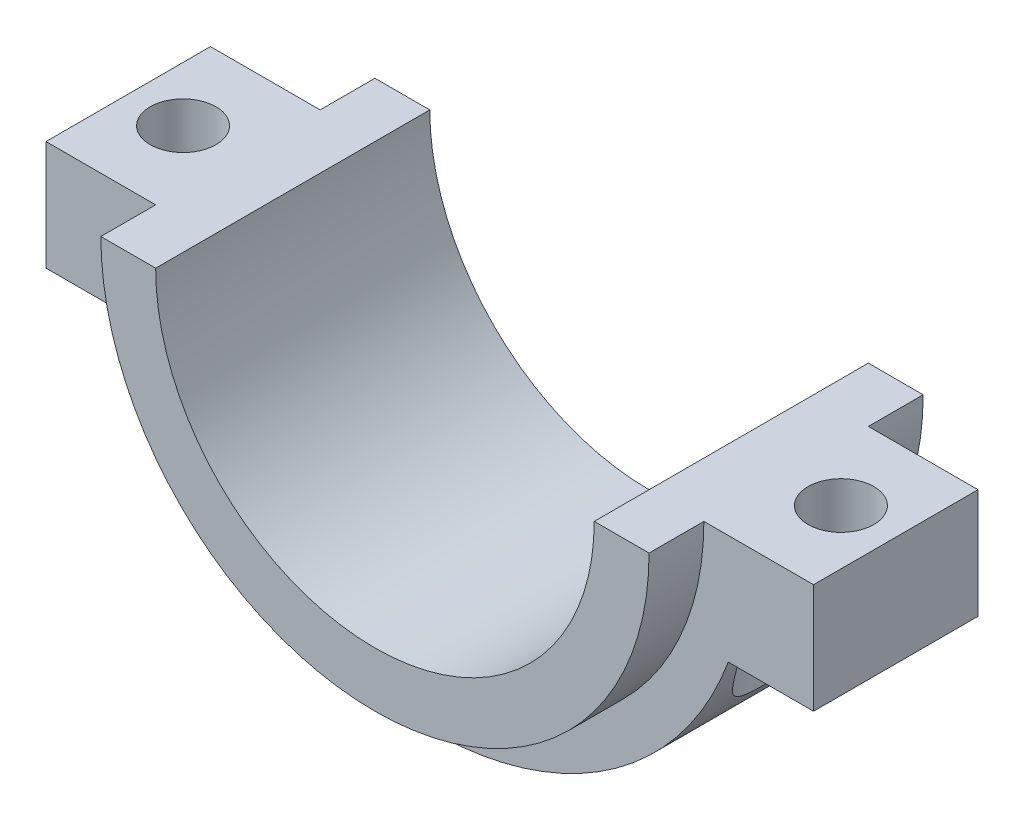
ISO-10303-21;
HEADER;
FILE_DESCRIPTION(('STEP AP214'),'2;1');
FILE_NAME('part.step','',(''),(''),'','','');
FILE_SCHEMA(('AUTOMOTIVE_DESIGN { 1 0 10303 214 1 1 1 1 }'));
ENDSEC;
DATA;
#1=APPLICATION_CONTEXT('core data for automotive mechanical design processes');
#2=APPLICATION_PROTOCOL_DEFINITION('international standard','automotive_design',2000,#1);
#3=PRODUCT_CONTEXT('',#1,'mechanical');
#4=PRODUCT('Part','Part','',(#3));
#5=PRODUCT_RELATED_PRODUCT_CATEGORY('part','',(#4));
#6=PRODUCT_DEFINITION_FORMATION('','',#4);
#7=PRODUCT_DEFINITION_CONTEXT('part definition',#1,'design');
#8=PRODUCT_DEFINITION('design','',#6,#7);
#9=PRODUCT_DEFINITION_SHAPE('','',#8);
#10=(LENGTH_UNIT() NAMED_UNIT(*) SI_UNIT(.MILLI.,.METRE.));
#11=(NAMED_UNIT(*) PLANE_ANGLE_UNIT() SI_UNIT($,.RADIAN.));
#12=(NAMED_UNIT(*) SI_UNIT($,.STERADIAN.) SOLID_ANGLE_UNIT());
#13=UNCERTAINTY_MEASURE_WITH_UNIT(LENGTH_MEASURE(1.E-05),#10,'distance_accuracy_value','');
#14=(GEOMETRIC_REPRESENTATION_CONTEXT(3) GLOBAL_UNCERTAINTY_ASSIGNED_CONTEXT((#13)) GLOBAL_UNIT_ASSIGNED_CONTEXT((#10,
#11,#12)) REPRESENTATION_CONTEXT('',''));
#15=CARTESIAN_POINT('',(0.,0.,0.));
#16=DIRECTION('',(0.,0.,1.));
#17=DIRECTION('',(1.,0.,0.));
#18=AXIS2_PLACEMENT_3D('',#15,#16,#17);
#19=CARTESIAN_POINT('',(0.,0.,15.));
#20=DIRECTION('',(0.,0.,-1.));
#21=DIRECTION('',(-1.,0.,0.));
#22=AXIS2_PLACEMENT_3D('',#19,#20,#21);
#23=CYLINDRICAL_SURFACE('',#22,58.);
#24=CARTESIAN_POINT('',(-54.4426303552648,-20.,-12.8497331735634));
#25=CARTESIAN_POINT('',(-54.2826467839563,-20.4355339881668,-12.7805017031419));
#26=CARTESIAN_POINT('',(-54.1176847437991,-20.8683993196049,-12.7056478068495));
#27=CARTESIAN_POINT('',(-53.7782681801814,-21.7281186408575,-12.5429569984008));
#28=CARTESIAN_POINT('',(-53.6038099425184,-22.1549701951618,-12.4551149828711));
#29=CARTESIAN_POINT('',(-53.2446160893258,-23.0048999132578,-12.2640294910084));
#30=CARTESIAN_POINT('',(-53.0598117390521,-23.4279237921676,-12.1606727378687));
#31=CARTESIAN_POINT('',(-52.6819381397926,-24.2657061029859,-11.9370927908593));
#32=CARTESIAN_POINT('',(-52.4888698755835,-24.6804655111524,-11.8168716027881));
#33=CARTESIAN_POINT('',(-52.0916321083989,-25.5083647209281,-11.554887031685));
#34=CARTESIAN_POINT('',(-51.8873205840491,-25.9213202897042,-11.4127541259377));
#35=CARTESIAN_POINT('',(-51.4723985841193,-26.7357633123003,-11.1061502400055));
#36=CARTESIAN_POINT('',(-51.2617871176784,-27.1372489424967,-10.9416757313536));
#37=CARTESIAN_POINT('',(-50.836767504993,-27.925307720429,-10.5882628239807));
#38=CARTESIAN_POINT('',(-50.6223743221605,-28.3119260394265,-10.3994076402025));
#39=CARTESIAN_POINT('',(-50.191466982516,-29.0689889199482,-9.99400586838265));
#40=CARTESIAN_POINT('',(-49.9749538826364,-29.439441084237,-9.77747248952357));
#41=CARTESIAN_POINT('',(-49.60349810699,-30.0596830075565,-9.37894550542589));
#42=CARTESIAN_POINT('',(-49.4483569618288,-30.3141178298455,-9.2043536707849));
#43=CARTESIAN_POINT('',(-49.1398326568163,-30.8117266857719,-8.83821754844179));
#44=CARTESIAN_POINT('',(-48.9864497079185,-31.0548993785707,-8.64667125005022));
#45=CARTESIAN_POINT('',(-48.6835324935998,-31.5276427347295,-8.24623571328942));
#46=CARTESIAN_POINT('',(-48.533988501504,-31.7572502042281,-8.03739748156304));
#47=CARTESIAN_POINT('',(-48.2402128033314,-32.2017519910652,-7.6010894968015));
#48=CARTESIAN_POINT('',(-48.0959809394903,-32.416646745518,-7.37362029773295));
#49=CARTESIAN_POINT('',(-47.81318875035,-32.8323469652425,-6.8963449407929));
#50=CARTESIAN_POINT('',(-47.6747285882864,-33.0329286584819,-6.64628328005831));
#51=CARTESIAN_POINT('',(-47.4082039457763,-33.4143131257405,-6.12633387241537));
#52=CARTESIAN_POINT('',(-47.2801369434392,-33.5951207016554,-5.85645096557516));
#53=CARTESIAN_POINT('',(-47.0374049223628,-33.9341418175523,-5.29753237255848));
#54=CARTESIAN_POINT('',(-46.9227258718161,-34.0923790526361,-5.00851724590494));
#55=CARTESIAN_POINT('',(-46.7097275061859,-34.3836289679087,-4.41233649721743));
#56=CARTESIAN_POINT('',(-46.6114011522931,-34.5166525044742,-4.1051787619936));
#57=CARTESIAN_POINT('',(-46.4589952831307,-34.7213647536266,-3.56325142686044));
#58=CARTESIAN_POINT('',(-46.4002381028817,-34.799794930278,-3.33231881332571));
#59=CARTESIAN_POINT('',(-46.293824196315,-34.9412318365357,-2.86330595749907));
#60=CARTESIAN_POINT('',(-46.2461647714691,-35.004242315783,-2.62522746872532));
#61=CARTESIAN_POINT('',(-46.1628881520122,-35.1139931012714,-2.14338233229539));
#62=CARTESIAN_POINT('',(-46.1272657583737,-35.1607404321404,-1.89961818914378));
#63=CARTESIAN_POINT('',(-46.0687740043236,-35.2373437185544,-1.40791792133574));
#64=CARTESIAN_POINT('',(-46.0459050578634,-35.2671991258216,-1.15998166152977));
#65=CARTESIAN_POINT('',(-46.0133746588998,-35.3096314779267,-0.661048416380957));
#66=CARTESIAN_POINT('',(-46.0037512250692,-35.322158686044,-0.410044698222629));
#67=CARTESIAN_POINT('',(-45.9980508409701,-35.3295816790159,0.092377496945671));
#68=CARTESIAN_POINT('',(-46.0019738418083,-35.3244775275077,0.343795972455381));
#69=CARTESIAN_POINT('',(-46.0232779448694,-35.2967164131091,0.845095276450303));
#70=CARTESIAN_POINT('',(-46.0406597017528,-35.2740585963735,1.09497602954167));
#71=CARTESIAN_POINT('',(-46.0884965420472,-35.2115326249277,1.5912980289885));
#72=CARTESIAN_POINT('',(-46.1189515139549,-35.1716646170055,1.83773930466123));
#73=CARTESIAN_POINT('',(-46.1908328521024,-35.077205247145,2.315819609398));
#74=CARTESIAN_POINT('',(-46.2317788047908,-35.0232570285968,2.54765898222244));
#75=CARTESIAN_POINT('',(-46.324359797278,-34.9007103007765,3.00522059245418));
#76=CARTESIAN_POINT('',(-46.3759942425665,-34.8321126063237,3.23094316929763));
#77=CARTESIAN_POINT('',(-46.4890663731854,-34.6810553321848,3.67521818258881));
#78=CARTESIAN_POINT('',(-46.5505061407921,-34.5985928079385,3.89376908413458));
#79=CARTESIAN_POINT('',(-46.6822018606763,-34.4206955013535,4.32280435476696));
#80=CARTESIAN_POINT('',(-46.7524596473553,-34.3252580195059,4.53328703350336));
#81=CARTESIAN_POINT('',(-46.9281261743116,-34.0849018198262,5.02155161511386));
#82=CARTESIAN_POINT('',(-47.0369434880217,-33.9347140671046,5.29552977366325));
#83=CARTESIAN_POINT('',(-47.2665667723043,-33.6141419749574,5.82608949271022));
#84=CARTESIAN_POINT('',(-47.3873763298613,-33.4437515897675,6.0826658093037));
#85=CARTESIAN_POINT('',(-47.6385784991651,-33.0849482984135,6.57818202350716));
#86=CARTESIAN_POINT('',(-47.7689782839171,-32.89652186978,6.81710844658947));
#87=CARTESIAN_POINT('',(-48.0370377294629,-32.5038397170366,7.27725705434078));
#88=CARTESIAN_POINT('',(-48.1746995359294,-32.2995793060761,7.49847395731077));
#89=CARTESIAN_POINT('',(-48.5178925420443,-31.7828306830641,8.01853893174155));
#90=CARTESIAN_POINT('',(-48.7262886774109,-31.4627327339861,8.30795969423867));
#91=CARTESIAN_POINT('',(-49.1489088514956,-30.798376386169,8.85284202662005));
#92=CARTESIAN_POINT('',(-49.3631356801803,-30.4541062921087,9.10828698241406));
#93=CARTESIAN_POINT('',(-49.7944975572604,-29.7435994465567,9.58919281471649));
#94=CARTESIAN_POINT('',(-50.0116421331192,-29.3772518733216,9.81448029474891));
#95=CARTESIAN_POINT('',(-50.4444289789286,-28.6277287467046,10.2363262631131));
#96=CARTESIAN_POINT('',(-50.6600714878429,-28.2445559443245,10.4328894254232));
#97=CARTESIAN_POINT('',(-51.0407332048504,-27.5493119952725,10.7601109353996));
#98=CARTESIAN_POINT('',(-51.2065200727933,-27.2399948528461,10.8957859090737));
#99=CARTESIAN_POINT('',(-51.5348057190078,-26.6136955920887,11.1527551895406));
#100=CARTESIAN_POINT('',(-51.6973041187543,-26.2967126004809,11.2740478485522));
#101=CARTESIAN_POINT('',(-52.0183942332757,-25.6557071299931,11.5036061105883));
#102=CARTESIAN_POINT('',(-52.1769818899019,-25.3316779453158,11.6118585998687));
#103=CARTESIAN_POINT('',(-52.4894812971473,-24.6776360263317,11.8163860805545));
#104=CARTESIAN_POINT('',(-52.6433928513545,-24.3476230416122,11.9126605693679));
#105=CARTESIAN_POINT('',(-52.9430663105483,-23.6888182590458,12.092544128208));
#106=CARTESIAN_POINT('',(-53.0889289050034,-23.3601297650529,12.1763648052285));
#107=CARTESIAN_POINT('',(-53.3753081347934,-22.698161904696,12.3345128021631));
#108=CARTESIAN_POINT('',(-53.5158245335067,-22.3648823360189,12.4088397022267));
#109=CARTESIAN_POINT('',(-53.7908324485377,-21.6950923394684,12.5487051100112));
#110=CARTESIAN_POINT('',(-53.9253388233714,-21.3585926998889,12.6142661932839));
#111=CARTESIAN_POINT('',(-54.1884579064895,-20.6819467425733,12.7376207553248));
#112=CARTESIAN_POINT('',(-54.3170715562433,-20.341801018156,12.7954154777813));
#113=CARTESIAN_POINT('',(-54.4426303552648,-20.,12.8497331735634));
#114=B_SPLINE_CURVE_WITH_KNOTS('',3,(#24,#25,#26,#27,#28,#29,#30,#31,#32,#33,#34,#35,#36,#37,
#38,#39,#40,#41,#42,#43,#44,#45,#46,#47,#48,#49,#50,#51,#52,#53,#54,#55,#56,#57,#58,#59,#60,#61,
#62,#63,#64,#65,#66,#67,#68,#69,#70,#71,#72,#73,#74,#75,#76,#77,#78,#79,#80,#81,#82,#83,#84,#85,
#86,#87,#88,#89,#90,#91,#92,#93,#94,#95,#96,#97,#98,#99,#100,#101,#102,#103,#104,#105,#106,#107,
#108,#109,#110,#111,#112,#113),.UNSPECIFIED.,.F.,.F.,(4,2,2,2,2,2,2,2,2,2,2,2,2,2,2,2,2,2,2,2,2,
2,2,2,2,2,2,2,2,2,2,2,2,2,2,2,2,2,2,2,2,2,2,2,4),(0.,1.40737975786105,2.81531398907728,
4.23407866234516,5.65267473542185,7.0985272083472,8.54460829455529,9.9858780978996,
11.4264626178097,12.4620816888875,13.4978237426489,14.5306126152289,15.5633707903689,
16.609779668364,17.655933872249,18.7009815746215,19.7455782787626,20.4974312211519,
21.2491011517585,22.0004460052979,22.7518152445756,23.5053366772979,24.2588553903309,
25.0124107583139,25.7659596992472,26.4897701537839,27.213540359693,27.9374644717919,
28.66153943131,29.6526139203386,30.6439857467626,31.6361067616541,32.6285225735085,
34.0639471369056,35.5000710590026,36.944126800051,38.3879473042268,39.5163502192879,
40.6448822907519,41.7745399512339,42.904244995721,44.0117633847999,45.1193307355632,
46.223988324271,47.3284688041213),.UNSPECIFIED.);
#115=CARTESIAN_POINT('',(-54.4426303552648,-20.,-12.8497331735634));
#116=VERTEX_POINT('',#115);
#117=CARTESIAN_POINT('',(-54.4426303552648,-20.,12.8497331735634));
#118=VERTEX_POINT('',#117);
#119=EDGE_CURVE('E11',#116,#118,#114,.T.);
#120=ORIENTED_EDGE('',*,*,#119,.F.);
#121=DIRECTION('',(0.,0.,-1.));
#122=VECTOR('',#121,1.);
#123=CARTESIAN_POINT('',(-54.4426303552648,-20.,15.));
#124=LINE('',#123,#122);
#125=CARTESIAN_POINT('',(-54.4426303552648,-20.,-15.));
#126=VERTEX_POINT('',#125);
#127=EDGE_CURVE('E129',#116,#126,#124,.T.);
#128=ORIENTED_EDGE('',*,*,#127,.T.);
#129=CARTESIAN_POINT('',(0.,0.,-15.));
#130=DIRECTION('',(0.,0.,1.));
#131=DIRECTION('',(1.,0.,0.));
#132=AXIS2_PLACEMENT_3D('',#129,#130,#131);
#133=CIRCLE('',#132,58.);
#134=CARTESIAN_POINT('',(54.4426303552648,-20.,-15.));
#135=VERTEX_POINT('',#134);
#136=EDGE_CURVE('E154',#126,#135,#133,.T.);
#137=ORIENTED_EDGE('',*,*,#136,.T.);
#138=DIRECTION('',(0.,0.,-1.));
#139=VECTOR('',#138,1.);
#140=CARTESIAN_POINT('',(54.4426303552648,-20.,15.));
#141=LINE('',#140,#139);
#142=CARTESIAN_POINT('',(54.4426303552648,-20.,-12.8497331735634));
#143=VERTEX_POINT('',#142);
#144=EDGE_CURVE('E130',#143,#135,#141,.T.);
#145=ORIENTED_EDGE('',*,*,#144,.F.);
#146=CARTESIAN_POINT('',(54.4426303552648,-20.,12.8497331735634));
#147=CARTESIAN_POINT('',(54.2826467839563,-20.4355339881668,12.7805017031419));
#148=CARTESIAN_POINT('',(54.1176847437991,-20.8683993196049,12.7056478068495));
#149=CARTESIAN_POINT('',(53.7782681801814,-21.7281186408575,12.5429569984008));
#150=CARTESIAN_POINT('',(53.6038099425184,-22.1549701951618,12.4551149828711));
#151=CARTESIAN_POINT('',(53.2446160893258,-23.0048999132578,12.2640294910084));
#152=CARTESIAN_POINT('',(53.0598117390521,-23.4279237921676,12.1606727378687));
#153=CARTESIAN_POINT('',(52.6819381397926,-24.2657061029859,11.9370927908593));
#154=CARTESIAN_POINT('',(52.4888698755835,-24.6804655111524,11.8168716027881));
#155=CARTESIAN_POINT('',(52.0916321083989,-25.5083647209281,11.554887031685));
#156=CARTESIAN_POINT('',(51.8873205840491,-25.9213202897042,11.4127541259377));
#157=CARTESIAN_POINT('',(51.4723985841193,-26.7357633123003,11.1061502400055));
#158=CARTESIAN_POINT('',(51.2617871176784,-27.1372489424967,10.9416757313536));
#159=CARTESIAN_POINT('',(50.836767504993,-27.9253077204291,10.5882628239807));
#160=CARTESIAN_POINT('',(50.6223743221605,-28.3119260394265,10.3994076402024));
#161=CARTESIAN_POINT('',(50.191466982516,-29.0689889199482,9.99400586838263));
#162=CARTESIAN_POINT('',(49.9749538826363,-29.439441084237,9.77747248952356));
#163=CARTESIAN_POINT('',(49.60349810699,-30.0596830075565,9.37894550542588));
#164=CARTESIAN_POINT('',(49.4483569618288,-30.3141178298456,9.20435367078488));
#165=CARTESIAN_POINT('',(49.1398326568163,-30.8117266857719,8.83821754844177));
#166=CARTESIAN_POINT('',(48.9864497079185,-31.0548993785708,8.6466712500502));
#167=CARTESIAN_POINT('',(48.6835324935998,-31.5276427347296,8.2462357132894));
#168=CARTESIAN_POINT('',(48.533988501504,-31.7572502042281,8.03739748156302));
#169=CARTESIAN_POINT('',(48.2402128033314,-32.2017519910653,7.60108949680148));
#170=CARTESIAN_POINT('',(48.0959809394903,-32.416646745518,7.37362029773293));
#171=CARTESIAN_POINT('',(47.81318875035,-32.8323469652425,6.89634494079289));
#172=CARTESIAN_POINT('',(47.6747285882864,-33.0329286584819,6.64628328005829));
#173=CARTESIAN_POINT('',(47.4082039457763,-33.4143131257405,6.12633387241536));
#174=CARTESIAN_POINT('',(47.2801369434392,-33.5951207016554,5.85645096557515));
#175=CARTESIAN_POINT('',(47.0374049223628,-33.9341418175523,5.29753237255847));
#176=CARTESIAN_POINT('',(46.9227258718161,-34.0923790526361,5.00851724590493));
#177=CARTESIAN_POINT('',(46.7097275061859,-34.3836289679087,4.41233649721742));
#178=CARTESIAN_POINT('',(46.6114011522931,-34.5166525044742,4.10517876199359));
#179=CARTESIAN_POINT('',(46.4589952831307,-34.7213647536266,3.56325142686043));
#180=CARTESIAN_POINT('',(46.4002381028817,-34.799794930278,3.3323188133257));
#181=CARTESIAN_POINT('',(46.293824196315,-34.9412318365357,2.86330595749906));
#182=CARTESIAN_POINT('',(46.2461647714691,-35.004242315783,2.62522746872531));
#183=CARTESIAN_POINT('',(46.1628881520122,-35.1139931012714,2.14338233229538));
#184=CARTESIAN_POINT('',(46.1272657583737,-35.1607404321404,1.89961818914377));
#185=CARTESIAN_POINT('',(46.0687740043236,-35.2373437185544,1.40791792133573));
#186=CARTESIAN_POINT('',(46.0459050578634,-35.2671991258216,1.15998166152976));
#187=CARTESIAN_POINT('',(46.0133746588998,-35.3096314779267,0.661048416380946));
#188=CARTESIAN_POINT('',(46.0037512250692,-35.3221586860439,0.410044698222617));
#189=CARTESIAN_POINT('',(45.9980508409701,-35.3295816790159,-0.092377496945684));
#190=CARTESIAN_POINT('',(46.0019738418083,-35.3244775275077,-0.343795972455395));
#191=CARTESIAN_POINT('',(46.0232779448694,-35.2967164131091,-0.845095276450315));
#192=CARTESIAN_POINT('',(46.0406597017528,-35.2740585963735,-1.09497602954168));
#193=CARTESIAN_POINT('',(46.0884965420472,-35.2115326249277,-1.59129802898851));
#194=CARTESIAN_POINT('',(46.1189515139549,-35.1716646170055,-1.83773930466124));
#195=CARTESIAN_POINT('',(46.1908328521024,-35.077205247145,-2.31581960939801));
#196=CARTESIAN_POINT('',(46.2317788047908,-35.0232570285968,-2.54765898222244));
#197=CARTESIAN_POINT('',(46.324359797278,-34.9007103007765,-3.00522059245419));
#198=CARTESIAN_POINT('',(46.3759942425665,-34.8321126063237,-3.23094316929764));
#199=CARTESIAN_POINT('',(46.4890663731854,-34.6810553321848,-3.67521818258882));
#200=CARTESIAN_POINT('',(46.5505061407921,-34.5985928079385,-3.89376908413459));
#201=CARTESIAN_POINT('',(46.6822018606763,-34.4206955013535,-4.32280435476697));
#202=CARTESIAN_POINT('',(46.7524596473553,-34.3252580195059,-4.53328703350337));
#203=CARTESIAN_POINT('',(46.9281261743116,-34.0849018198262,-5.02155161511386));
#204=CARTESIAN_POINT('',(47.0369434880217,-33.9347140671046,-5.29552977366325));
#205=CARTESIAN_POINT('',(47.2665667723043,-33.6141419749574,-5.82608949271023));
#206=CARTESIAN_POINT('',(47.3873763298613,-33.4437515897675,-6.08266580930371));
#207=CARTESIAN_POINT('',(47.6385784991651,-33.0849482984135,-6.57818202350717));
#208=CARTESIAN_POINT('',(47.7689782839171,-32.89652186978,-6.81710844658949));
#209=CARTESIAN_POINT('',(48.0370377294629,-32.5038397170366,-7.27725705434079));
#210=CARTESIAN_POINT('',(48.1746995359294,-32.2995793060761,-7.49847395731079));
#211=CARTESIAN_POINT('',(48.5178925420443,-31.782830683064,-8.01853893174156));
#212=CARTESIAN_POINT('',(48.7262886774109,-31.4627327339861,-8.30795969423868));
#213=CARTESIAN_POINT('',(49.1489088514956,-30.798376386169,-8.85284202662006));
#214=CARTESIAN_POINT('',(49.3631356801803,-30.4541062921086,-9.10828698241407));
#215=CARTESIAN_POINT('',(49.7944975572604,-29.7435994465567,-9.58919281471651));
#216=CARTESIAN_POINT('',(50.0116421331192,-29.3772518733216,-9.81448029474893));
#217=CARTESIAN_POINT('',(50.4444289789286,-28.6277287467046,-10.2363262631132));
#218=CARTESIAN_POINT('',(50.6600714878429,-28.2445559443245,-10.4328894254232));
#219=CARTESIAN_POINT('',(51.0407332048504,-27.5493119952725,-10.7601109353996));
#220=CARTESIAN_POINT('',(51.2065200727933,-27.2399948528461,-10.8957859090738));
#221=CARTESIAN_POINT('',(51.5348057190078,-26.6136955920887,-11.1527551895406));
#222=CARTESIAN_POINT('',(51.6973041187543,-26.2967126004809,-11.2740478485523));
#223=CARTESIAN_POINT('',(52.0183942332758,-25.6557071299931,-11.5036061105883));
#224=CARTESIAN_POINT('',(52.1769818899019,-25.3316779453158,-11.6118585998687));
#225=CARTESIAN_POINT('',(52.4894812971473,-24.6776360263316,-11.8163860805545));
#226=CARTESIAN_POINT('',(52.6433928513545,-24.3476230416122,-11.912660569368));
#227=CARTESIAN_POINT('',(52.9430663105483,-23.6888182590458,-12.092544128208));
#228=CARTESIAN_POINT('',(53.0889289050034,-23.3601297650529,-12.1763648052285));
#229=CARTESIAN_POINT('',(53.3753081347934,-22.698161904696,-12.3345128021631));
#230=CARTESIAN_POINT('',(53.5158245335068,-22.3648823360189,-12.4088397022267));
#231=CARTESIAN_POINT('',(53.7908324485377,-21.6950923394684,-12.5487051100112));
#232=CARTESIAN_POINT('',(53.9253388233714,-21.3585926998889,-12.6142661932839));
#233=CARTESIAN_POINT('',(54.1884579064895,-20.6819467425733,-12.7376207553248));
#234=CARTESIAN_POINT('',(54.3170715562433,-20.341801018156,-12.7954154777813));
#235=CARTESIAN_POINT('',(54.4426303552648,-20.,-12.8497331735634));
#236=B_SPLINE_CURVE_WITH_KNOTS('',3,(#146,#147,#148,#149,#150,#151,#152,#153,#154,#155,#156,
#157,#158,#159,#160,#161,#162,#163,#164,#165,#166,#167,#168,#169,#170,#171,#172,#173,#174,#175,
#176,#177,#178,#179,#180,#181,#182,#183,#184,#185,#186,#187,#188,#189,#190,#191,#192,#193,#194,
#195,#196,#197,#198,#199,#200,#201,#202,#203,#204,#205,#206,#207,#208,#209,#210,#211,#212,#213,
#214,#215,#216,#217,#218,#219,#220,#221,#222,#223,#224,#225,#226,#227,#228,#229,#230,#231,#232,
#233,#234,#235),.UNSPECIFIED.,.F.,.F.,(4,2,2,2,2,2,2,2,2,2,2,2,2,2,2,2,2,2,2,2,2,2,2,2,2,2,2,2,
2,2,2,2,2,2,2,2,2,2,2,2,2,2,2,2,4),(0.,1.40737975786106,2.81531398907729,4.23407866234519,
5.65267473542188,7.09852720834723,8.54460829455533,9.98587809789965,11.4264626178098,
12.4620816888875,13.4978237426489,14.5306126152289,15.5633707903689,16.609779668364,
17.655933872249,18.7009815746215,19.7455782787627,20.4974312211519,21.2491011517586,
22.0004460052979,22.7518152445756,23.5053366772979,24.2588553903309,25.0124107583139,
25.7659596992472,26.4897701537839,27.213540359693,27.937464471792,28.66153943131,
29.6526139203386,30.6439857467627,31.6361067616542,32.6285225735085,34.0639471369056,
35.5000710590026,36.944126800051,38.3879473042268,39.5163502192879,40.6448822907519,
41.7745399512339,42.904244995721,44.0117633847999,45.1193307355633,46.223988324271,
47.3284688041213),.UNSPECIFIED.);
#237=CARTESIAN_POINT('',(54.4426303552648,-20.,12.8497331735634));
#238=VERTEX_POINT('',#237);
#239=EDGE_CURVE('E126',#238,#143,#236,.T.);
#240=ORIENTED_EDGE('',*,*,#239,.F.);
#241=CARTESIAN_POINT('',(54.4426303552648,-20.,15.));
#242=VERTEX_POINT('',#241);
#243=EDGE_CURVE('E121',#242,#238,#141,.T.);
#244=ORIENTED_EDGE('',*,*,#243,.F.);
#245=CARTESIAN_POINT('',(0.,0.,15.));
#246=DIRECTION('',(0.,0.,1.));
#247=DIRECTION('',(1.,0.,0.));
#248=AXIS2_PLACEMENT_3D('',#245,#246,#247);
#249=CIRCLE('',#248,58.);
#250=CARTESIAN_POINT('',(-54.4426303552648,-20.,15.));
#251=VERTEX_POINT('',#250);
#252=EDGE_CURVE('E108',#251,#242,#249,.T.);
#253=ORIENTED_EDGE('',*,*,#252,.F.);
#254=EDGE_CURVE('E169',#251,#118,#124,.T.);
#255=ORIENTED_EDGE('',*,*,#254,.T.);
#256=EDGE_LOOP('',(#120,#128,#137,#145,#240,#244,#253,#255));
#257=FACE_BOUND('',#256,.T.);
#258=ADVANCED_FACE('F34',(#257),#23,.T.);
#259=CARTESIAN_POINT('',(0.,0.,15.));
#260=DIRECTION('',(0.,-1.,0.));
#261=DIRECTION('',(1.,0.,0.));
#262=AXIS2_PLACEMENT_3D('',#259,#260,#261);
#263=PLANE('',#262);
#264=CARTESIAN_POINT('',(-60.,0.,0.));
#265=DIRECTION('',(0.,-1.,0.));
#266=DIRECTION('',(0.,0.,-1.));
#267=AXIS2_PLACEMENT_3D('',#264,#265,#266);
#268=CIRCLE('',#267,6.);
#269=CARTESIAN_POINT('',(-60.,0.,-6.));
#270=VERTEX_POINT('',#269);
#271=EDGE_CURVE('E221',#270,#270,#268,.T.);
#272=ORIENTED_EDGE('',*,*,#271,.T.);
#273=EDGE_LOOP('',(#272));
#274=FACE_BOUND('',#273,.T.);
#275=DIRECTION('',(-1.,0.,0.));
#276=VECTOR('',#275,1.);
#277=CARTESIAN_POINT('',(0.,0.,-15.));
#278=LINE('',#277,#276);
#279=CARTESIAN_POINT('',(-50.,0.,-15.));
#280=VERTEX_POINT('',#279);
#281=CARTESIAN_POINT('',(-70.,0.,-15.));
#282=VERTEX_POINT('',#281);
#283=EDGE_CURVE('E145',#280,#282,#278,.T.);
#284=ORIENTED_EDGE('',*,*,#283,.T.);
#285=DIRECTION('',(0.,0.,-1.));
#286=VECTOR('',#285,1.);
#287=CARTESIAN_POINT('',(-70.,0.,15.));
#288=LINE('',#287,#286);
#289=CARTESIAN_POINT('',(-70.,0.,15.));
#290=VERTEX_POINT('',#289);
#291=EDGE_CURVE('E48',#290,#282,#288,.T.);
#292=ORIENTED_EDGE('',*,*,#291,.F.);
#293=DIRECTION('',(-1.,0.,0.));
#294=VECTOR('',#293,1.);
#295=CARTESIAN_POINT('',(0.,0.,15.));
#296=LINE('',#295,#294);
#297=CARTESIAN_POINT('',(-50.,0.,15.));
#298=VERTEX_POINT('',#297);
#299=EDGE_CURVE('E97',#298,#290,#296,.T.);
#300=ORIENTED_EDGE('',*,*,#299,.F.);
#301=DIRECTION('',(0.,0.,-1.));
#302=VECTOR('',#301,1.);
#303=CARTESIAN_POINT('',(-50.,0.,25.));
#304=LINE('',#303,#302);
#305=CARTESIAN_POINT('',(-50.,0.,25.));
#306=VERTEX_POINT('',#305);
#307=EDGE_CURVE('E146',#306,#298,#304,.T.);
#308=ORIENTED_EDGE('',*,*,#307,.F.);
#309=DIRECTION('',(-1.,0.,0.));
#310=VECTOR('',#309,1.);
#311=CARTESIAN_POINT('',(0.,0.,25.));
#312=LINE('',#311,#310);
#313=CARTESIAN_POINT('',(-40.,0.,25.));
#314=VERTEX_POINT('',#313);
#315=EDGE_CURVE('E212',#314,#306,#312,.T.);
#316=ORIENTED_EDGE('',*,*,#315,.F.);
#317=DIRECTION('',(0.,0.,-1.));
#318=VECTOR('',#317,1.);
#319=CARTESIAN_POINT('',(-40.,0.,25.));
#320=LINE('',#319,#318);
#321=CARTESIAN_POINT('',(-40.,0.,-25.));
#322=VERTEX_POINT('',#321);
#323=EDGE_CURVE('E205',#314,#322,#320,.T.);
#324=ORIENTED_EDGE('',*,*,#323,.T.);
#325=DIRECTION('',(-1.,0.,0.));
#326=VECTOR('',#325,1.);
#327=CARTESIAN_POINT('',(0.,0.,-25.));
#328=LINE('',#327,#326);
#329=CARTESIAN_POINT('',(-50.,0.,-25.));
#330=VERTEX_POINT('',#329);
#331=EDGE_CURVE('E218',#322,#330,#328,.T.);
#332=ORIENTED_EDGE('',*,*,#331,.T.);
#333=EDGE_CURVE('E198',#280,#330,#304,.T.);
#334=ORIENTED_EDGE('',*,*,#333,.F.);
#335=EDGE_LOOP('',(#284,#292,#300,#308,#316,#324,#332,#334));
#336=FACE_BOUND('',#335,.T.);
#337=ADVANCED_FACE('F36',(#274,#336),#263,.F.);
#338=CARTESIAN_POINT('',(-70.,0.,15.));
#339=DIRECTION('',(1.,0.,0.));
#340=DIRECTION('',(0.,0.,-1.));
#341=AXIS2_PLACEMENT_3D('',#338,#339,#340);
#342=PLANE('',#341);
#343=DIRECTION('',(0.,-1.,0.));
#344=VECTOR('',#343,1.);
#345=CARTESIAN_POINT('',(-70.,0.,-15.));
#346=LINE('',#345,#344);
#347=CARTESIAN_POINT('',(-70.,-20.,-15.));
#348=VERTEX_POINT('',#347);
#349=EDGE_CURVE('E148',#282,#348,#346,.T.);
#350=ORIENTED_EDGE('',*,*,#349,.T.);
#351=DIRECTION('',(0.,0.,-1.));
#352=VECTOR('',#351,1.);
#353=CARTESIAN_POINT('',(-70.,-20.,15.));
#354=LINE('',#353,#352);
#355=CARTESIAN_POINT('',(-70.,-20.,15.));
#356=VERTEX_POINT('',#355);
#357=EDGE_CURVE('E171',#356,#348,#354,.T.);
#358=ORIENTED_EDGE('',*,*,#357,.F.);
#359=DIRECTION('',(0.,-1.,0.));
#360=VECTOR('',#359,1.);
#361=CARTESIAN_POINT('',(-70.,0.,15.));
#362=LINE('',#361,#360);
#363=EDGE_CURVE('E179',#290,#356,#362,.T.);
#364=ORIENTED_EDGE('',*,*,#363,.F.);
#365=ORIENTED_EDGE('',*,*,#291,.T.);
#366=EDGE_LOOP('',(#350,#358,#364,#365));
#367=FACE_BOUND('',#366,.T.);
#368=ADVANCED_FACE('F176',(#367),#342,.F.);
#369=CARTESIAN_POINT('',(0.,-20.,15.));
#370=DIRECTION('',(0.,1.,0.));
#371=DIRECTION('',(0.,0.,1.));
#372=AXIS2_PLACEMENT_3D('',#369,#370,#371);
#373=PLANE('',#372);
#374=ORIENTED_EDGE('',*,*,#357,.T.);
#375=DIRECTION('',(1.,0.,0.));
#376=VECTOR('',#375,1.);
#377=CARTESIAN_POINT('',(0.,-20.,-15.));
#378=LINE('',#377,#376);
#379=EDGE_CURVE('E151',#348,#126,#378,.T.);
#380=ORIENTED_EDGE('',*,*,#379,.T.);
#381=ORIENTED_EDGE('',*,*,#127,.F.);
#382=CARTESIAN_POINT('',(-60.,-20.,0.));
#383=DIRECTION('',(0.,-1.,0.));
#384=DIRECTION('',(0.,0.,-1.));
#385=AXIS2_PLACEMENT_3D('',#382,#383,#384);
#386=CIRCLE('',#385,14.);
#387=EDGE_CURVE('E248',#116,#118,#386,.T.);
#388=ORIENTED_EDGE('',*,*,#387,.T.);
#389=ORIENTED_EDGE('',*,*,#254,.F.);
#390=DIRECTION('',(1.,0.,0.));
#391=VECTOR('',#390,1.);
#392=CARTESIAN_POINT('',(0.,-20.,15.));
#393=LINE('',#392,#391);
#394=EDGE_CURVE('E114',#356,#251,#393,.T.);
#395=ORIENTED_EDGE('',*,*,#394,.F.);
#396=EDGE_LOOP('',(#374,#380,#381,#388,#389,#395));
#397=FACE_BOUND('',#396,.T.);
#398=CARTESIAN_POINT('',(-60.,-20.,0.));
#399=DIRECTION('',(0.,-1.,0.));
#400=DIRECTION('',(0.,0.,-1.));
#401=AXIS2_PLACEMENT_3D('',#398,#399,#400);
#402=CIRCLE('',#401,6.);
#403=CARTESIAN_POINT('',(-60.,-20.,-6.));
#404=VERTEX_POINT('',#403);
#405=EDGE_CURVE('E238',#404,#404,#402,.T.);
#406=ORIENTED_EDGE('',*,*,#405,.F.);
#407=EDGE_LOOP('',(#406));
#408=FACE_BOUND('',#407,.T.);
#409=ADVANCED_FACE('F187',(#397,#408),#373,.F.);
#410=CARTESIAN_POINT('',(0.,-20.,15.));
#411=DIRECTION('',(0.,-1.,0.));
#412=DIRECTION('',(0.,0.,-1.));
#413=AXIS2_PLACEMENT_3D('',#410,#411,#412);
#414=PLANE('',#413);
#415=CARTESIAN_POINT('',(60.,-20.,0.));
#416=DIRECTION('',(0.,-1.,0.));
#417=DIRECTION('',(0.,0.,-1.));
#418=AXIS2_PLACEMENT_3D('',#415,#416,#417);
#419=CIRCLE('',#418,14.);
#420=EDGE_CURVE('E249',#238,#143,#419,.T.);
#421=ORIENTED_EDGE('',*,*,#420,.T.);
#422=ORIENTED_EDGE('',*,*,#144,.T.);
#423=DIRECTION('',(-1.,0.,0.));
#424=VECTOR('',#423,1.);
#425=CARTESIAN_POINT('',(0.,-20.,-15.));
#426=LINE('',#425,#424);
#427=CARTESIAN_POINT('',(70.,-20.,-15.));
#428=VERTEX_POINT('',#427);
#429=EDGE_CURVE('E157',#428,#135,#426,.T.);
#430=ORIENTED_EDGE('',*,*,#429,.F.);
#431=DIRECTION('',(0.,0.,-1.));
#432=VECTOR('',#431,1.);
#433=CARTESIAN_POINT('',(70.,-20.,15.));
#434=LINE('',#433,#432);
#435=CARTESIAN_POINT('',(70.,-20.,15.));
#436=VERTEX_POINT('',#435);
#437=EDGE_CURVE('E135',#436,#428,#434,.T.);
#438=ORIENTED_EDGE('',*,*,#437,.F.);
#439=DIRECTION('',(-1.,0.,0.));
#440=VECTOR('',#439,1.);
#441=CARTESIAN_POINT('',(0.,-20.,15.));
#442=LINE('',#441,#440);
#443=EDGE_CURVE('E112',#436,#242,#442,.T.);
#444=ORIENTED_EDGE('',*,*,#443,.T.);
#445=ORIENTED_EDGE('',*,*,#243,.T.);
#446=EDGE_LOOP('',(#421,#422,#430,#438,#444,#445));
#447=FACE_BOUND('',#446,.T.);
#448=CARTESIAN_POINT('',(60.,-20.,0.));
#449=DIRECTION('',(0.,-1.,0.));
#450=DIRECTION('',(0.,0.,-1.));
#451=AXIS2_PLACEMENT_3D('',#448,#449,#450);
#452=CIRCLE('',#451,6.);
#453=CARTESIAN_POINT('',(60.,-20.,-6.));
#454=VERTEX_POINT('',#453);
#455=EDGE_CURVE('E235',#454,#454,#452,.T.);
#456=ORIENTED_EDGE('',*,*,#455,.F.);
#457=EDGE_LOOP('',(#456));
#458=FACE_BOUND('',#457,.T.);
#459=ADVANCED_FACE('F132',(#447,#458),#414,.T.);
#460=CARTESIAN_POINT('',(70.,0.,15.));
#461=DIRECTION('',(1.,0.,0.));
#462=DIRECTION('',(0.,0.,-1.));
#463=AXIS2_PLACEMENT_3D('',#460,#461,#462);
#464=PLANE('',#463);
#465=DIRECTION('',(0.,-1.,0.));
#466=VECTOR('',#465,1.);
#467=CARTESIAN_POINT('',(70.,0.,-15.));
#468=LINE('',#467,#466);
#469=CARTESIAN_POINT('',(70.,0.,-15.));
#470=VERTEX_POINT('',#469);
#471=EDGE_CURVE('E160',#470,#428,#468,.T.);
#472=ORIENTED_EDGE('',*,*,#471,.F.);
#473=DIRECTION('',(0.,0.,-1.));
#474=VECTOR('',#473,1.);
#475=CARTESIAN_POINT('',(70.,0.,15.));
#476=LINE('',#475,#474);
#477=CARTESIAN_POINT('',(70.,0.,15.));
#478=VERTEX_POINT('',#477);
#479=EDGE_CURVE('E56',#478,#470,#476,.T.);
#480=ORIENTED_EDGE('',*,*,#479,.F.);
#481=DIRECTION('',(0.,-1.,0.));
#482=VECTOR('',#481,1.);
#483=CARTESIAN_POINT('',(70.,0.,15.));
#484=LINE('',#483,#482);
#485=EDGE_CURVE('E136',#478,#436,#484,.T.);
#486=ORIENTED_EDGE('',*,*,#485,.T.);
#487=ORIENTED_EDGE('',*,*,#437,.T.);
#488=EDGE_LOOP('',(#472,#480,#486,#487));
#489=FACE_BOUND('',#488,.T.);
#490=ADVANCED_FACE('F293',(#489),#464,.T.);
#491=CARTESIAN_POINT('',(0.,0.,15.));
#492=DIRECTION('',(0.,1.,0.));
#493=DIRECTION('',(-1.,0.,0.));
#494=AXIS2_PLACEMENT_3D('',#491,#492,#493);
#495=PLANE('',#494);
#496=CARTESIAN_POINT('',(60.,0.,0.));
#497=DIRECTION('',(0.,-1.,0.));
#498=DIRECTION('',(0.,0.,-1.));
#499=AXIS2_PLACEMENT_3D('',#496,#497,#498);
#500=CIRCLE('',#499,6.);
#501=CARTESIAN_POINT('',(60.,0.,-6.));
#502=VERTEX_POINT('',#501);
#503=EDGE_CURVE('E232',#502,#502,#500,.T.);
#504=ORIENTED_EDGE('',*,*,#503,.T.);
#505=EDGE_LOOP('',(#504));
#506=FACE_BOUND('',#505,.T.);
#507=DIRECTION('',(1.,0.,0.));
#508=VECTOR('',#507,1.);
#509=CARTESIAN_POINT('',(0.,0.,-15.));
#510=LINE('',#509,#508);
#511=CARTESIAN_POINT('',(50.,0.,-15.));
#512=VERTEX_POINT('',#511);
#513=EDGE_CURVE('E163',#512,#470,#510,.T.);
#514=ORIENTED_EDGE('',*,*,#513,.F.);
#515=DIRECTION('',(0.,0.,-1.));
#516=VECTOR('',#515,1.);
#517=CARTESIAN_POINT('',(50.,0.,25.));
#518=LINE('',#517,#516);
#519=CARTESIAN_POINT('',(50.,0.,-25.));
#520=VERTEX_POINT('',#519);
#521=EDGE_CURVE('E88',#512,#520,#518,.T.);
#522=ORIENTED_EDGE('',*,*,#521,.T.);
#523=DIRECTION('',(1.,0.,0.));
#524=VECTOR('',#523,1.);
#525=CARTESIAN_POINT('',(0.,0.,-25.));
#526=LINE('',#525,#524);
#527=CARTESIAN_POINT('',(40.,0.,-25.));
#528=VERTEX_POINT('',#527);
#529=EDGE_CURVE('E213',#528,#520,#526,.T.);
#530=ORIENTED_EDGE('',*,*,#529,.F.);
#531=DIRECTION('',(0.,0.,-1.));
#532=VECTOR('',#531,1.);
#533=CARTESIAN_POINT('',(40.,0.,25.));
#534=LINE('',#533,#532);
#535=CARTESIAN_POINT('',(40.,0.,25.));
#536=VERTEX_POINT('',#535);
#537=EDGE_CURVE('E202',#536,#528,#534,.T.);
#538=ORIENTED_EDGE('',*,*,#537,.F.);
#539=DIRECTION('',(1.,0.,0.));
#540=VECTOR('',#539,1.);
#541=CARTESIAN_POINT('',(0.,0.,25.));
#542=LINE('',#541,#540);
#543=CARTESIAN_POINT('',(50.,0.,25.));
#544=VERTEX_POINT('',#543);
#545=EDGE_CURVE('E224',#536,#544,#542,.T.);
#546=ORIENTED_EDGE('',*,*,#545,.T.);
#547=CARTESIAN_POINT('',(50.,0.,15.));
#548=VERTEX_POINT('',#547);
#549=EDGE_CURVE('E199',#544,#548,#518,.T.);
#550=ORIENTED_EDGE('',*,*,#549,.T.);
#551=DIRECTION('',(1.,0.,0.));
#552=VECTOR('',#551,1.);
#553=CARTESIAN_POINT('',(0.,0.,15.));
#554=LINE('',#553,#552);
#555=EDGE_CURVE('E138',#548,#478,#554,.T.);
#556=ORIENTED_EDGE('',*,*,#555,.T.);
#557=ORIENTED_EDGE('',*,*,#479,.T.);
#558=EDGE_LOOP('',(#514,#522,#530,#538,#546,#550,#556,#557));
#559=FACE_BOUND('',#558,.T.);
#560=ADVANCED_FACE('F288',(#506,#559),#495,.T.);
#561=CARTESIAN_POINT('',(0.,0.,15.));
#562=DIRECTION('',(0.,0.,1.));
#563=DIRECTION('',(1.,0.,0.));
#564=AXIS2_PLACEMENT_3D('',#561,#562,#563);
#565=PLANE('',#564);
#566=CARTESIAN_POINT('',(0.,0.,15.));
#567=DIRECTION('',(0.,0.,1.));
#568=DIRECTION('',(1.,0.,0.));
#569=AXIS2_PLACEMENT_3D('',#566,#567,#568);
#570=CIRCLE('',#569,50.);
#571=EDGE_CURVE('E166',#298,#548,#570,.T.);
#572=ORIENTED_EDGE('',*,*,#571,.F.);
#573=ORIENTED_EDGE('',*,*,#299,.T.);
#574=ORIENTED_EDGE('',*,*,#363,.T.);
#575=ORIENTED_EDGE('',*,*,#394,.T.);
#576=ORIENTED_EDGE('',*,*,#252,.T.);
#577=ORIENTED_EDGE('',*,*,#443,.F.);
#578=ORIENTED_EDGE('',*,*,#485,.F.);
#579=ORIENTED_EDGE('',*,*,#555,.F.);
#580=EDGE_LOOP('',(#572,#573,#574,#575,#576,#577,#578,#579));
#581=FACE_BOUND('',#580,.T.);
#582=ADVANCED_FACE('F110',(#581),#565,.T.);
#583=CARTESIAN_POINT('',(0.,0.,-15.));
#584=DIRECTION('',(0.,0.,1.));
#585=DIRECTION('',(1.,0.,0.));
#586=AXIS2_PLACEMENT_3D('',#583,#584,#585);
#587=PLANE('',#586);
#588=CARTESIAN_POINT('',(0.,0.,-15.));
#589=DIRECTION('',(0.,0.,1.));
#590=DIRECTION('',(1.,0.,0.));
#591=AXIS2_PLACEMENT_3D('',#588,#589,#590);
#592=CIRCLE('',#591,50.);
#593=EDGE_CURVE('E143',#280,#512,#592,.T.);
#594=ORIENTED_EDGE('',*,*,#593,.T.);
#595=ORIENTED_EDGE('',*,*,#513,.T.);
#596=ORIENTED_EDGE('',*,*,#471,.T.);
#597=ORIENTED_EDGE('',*,*,#429,.T.);
#598=ORIENTED_EDGE('',*,*,#136,.F.);
#599=ORIENTED_EDGE('',*,*,#379,.F.);
#600=ORIENTED_EDGE('',*,*,#349,.F.);
#601=ORIENTED_EDGE('',*,*,#283,.F.);
#602=EDGE_LOOP('',(#594,#595,#596,#597,#598,#599,#600,#601));
#603=FACE_BOUND('',#602,.T.);
#604=ADVANCED_FACE('F183',(#603),#587,.F.);
#605=CARTESIAN_POINT('',(0.,0.,25.));
#606=DIRECTION('',(0.,0.,-1.));
#607=DIRECTION('',(-1.,0.,0.));
#608=AXIS2_PLACEMENT_3D('',#605,#606,#607);
#609=CYLINDRICAL_SURFACE('',#608,50.);
#610=ORIENTED_EDGE('',*,*,#521,.F.);
#611=ORIENTED_EDGE('',*,*,#593,.F.);
#612=ORIENTED_EDGE('',*,*,#333,.T.);
#613=CARTESIAN_POINT('',(0.,0.,-25.));
#614=DIRECTION('',(0.,0.,1.));
#615=DIRECTION('',(1.,0.,0.));
#616=AXIS2_PLACEMENT_3D('',#613,#614,#615);
#617=CIRCLE('',#616,50.);
#618=EDGE_CURVE('E216',#330,#520,#617,.T.);
#619=ORIENTED_EDGE('',*,*,#618,.T.);
#620=EDGE_LOOP('',(#610,#611,#612,#619));
#621=FACE_BOUND('',#620,.T.);
#622=ADVANCED_FACE('F284',(#621),#609,.T.);
#623=ORIENTED_EDGE('',*,*,#571,.T.);
#624=ORIENTED_EDGE('',*,*,#549,.F.);
#625=CARTESIAN_POINT('',(0.,0.,25.));
#626=DIRECTION('',(0.,0.,1.));
#627=DIRECTION('',(1.,0.,0.));
#628=AXIS2_PLACEMENT_3D('',#625,#626,#627);
#629=CIRCLE('',#628,50.);
#630=EDGE_CURVE('E227',#306,#544,#629,.T.);
#631=ORIENTED_EDGE('',*,*,#630,.F.);
#632=ORIENTED_EDGE('',*,*,#307,.T.);
#633=EDGE_LOOP('',(#623,#624,#631,#632));
#634=FACE_BOUND('',#633,.T.);
#635=ADVANCED_FACE('F280',(#634),#609,.T.);
#636=CARTESIAN_POINT('',(0.,0.,25.));
#637=DIRECTION('',(0.,0.,-1.));
#638=DIRECTION('',(-1.,0.,0.));
#639=AXIS2_PLACEMENT_3D('',#636,#637,#638);
#640=CYLINDRICAL_SURFACE('',#639,40.);
#641=CARTESIAN_POINT('',(0.,0.,-25.));
#642=DIRECTION('',(0.,0.,1.));
#643=DIRECTION('',(1.,0.,0.));
#644=AXIS2_PLACEMENT_3D('',#641,#642,#643);
#645=CIRCLE('',#644,40.);
#646=EDGE_CURVE('E209',#322,#528,#645,.T.);
#647=ORIENTED_EDGE('',*,*,#646,.F.);
#648=ORIENTED_EDGE('',*,*,#323,.F.);
#649=CARTESIAN_POINT('',(0.,0.,25.));
#650=DIRECTION('',(0.,0.,1.));
#651=DIRECTION('',(1.,0.,0.));
#652=AXIS2_PLACEMENT_3D('',#649,#650,#651);
#653=CIRCLE('',#652,40.);
#654=EDGE_CURVE('E208',#314,#536,#653,.T.);
#655=ORIENTED_EDGE('',*,*,#654,.T.);
#656=ORIENTED_EDGE('',*,*,#537,.T.);
#657=EDGE_LOOP('',(#647,#648,#655,#656));
#658=FACE_BOUND('',#657,.T.);
#659=ADVANCED_FACE('F273',(#658),#640,.F.);
#660=CARTESIAN_POINT('',(0.,0.,25.));
#661=DIRECTION('',(0.,0.,1.));
#662=DIRECTION('',(1.,0.,0.));
#663=AXIS2_PLACEMENT_3D('',#660,#661,#662);
#664=PLANE('',#663);
#665=ORIENTED_EDGE('',*,*,#315,.T.);
#666=ORIENTED_EDGE('',*,*,#630,.T.);
#667=ORIENTED_EDGE('',*,*,#545,.F.);
#668=ORIENTED_EDGE('',*,*,#654,.F.);
#669=EDGE_LOOP('',(#665,#666,#667,#668));
#670=FACE_BOUND('',#669,.T.);
#671=ADVANCED_FACE('F270',(#670),#664,.T.);
#672=CARTESIAN_POINT('',(0.,0.,-25.));
#673=DIRECTION('',(0.,0.,1.));
#674=DIRECTION('',(1.,0.,0.));
#675=AXIS2_PLACEMENT_3D('',#672,#673,#674);
#676=PLANE('',#675);
#677=ORIENTED_EDGE('',*,*,#331,.F.);
#678=ORIENTED_EDGE('',*,*,#646,.T.);
#679=ORIENTED_EDGE('',*,*,#529,.T.);
#680=ORIENTED_EDGE('',*,*,#618,.F.);
#681=EDGE_LOOP('',(#677,#678,#679,#680));
#682=FACE_BOUND('',#681,.T.);
#683=ADVANCED_FACE('F268',(#682),#676,.F.);
#684=CARTESIAN_POINT('',(60.,0.,0.));
#685=DIRECTION('',(0.,-1.,0.));
#686=DIRECTION('',(0.,0.,-1.));
#687=AXIS2_PLACEMENT_3D('',#684,#685,#686);
#688=CYLINDRICAL_SURFACE('',#687,6.);
#689=ORIENTED_EDGE('',*,*,#503,.F.);
#690=EDGE_LOOP('',(#689));
#691=FACE_BOUND('',#690,.T.);
#692=ORIENTED_EDGE('',*,*,#455,.T.);
#693=EDGE_LOOP('',(#692));
#694=FACE_BOUND('',#693,.T.);
#695=ADVANCED_FACE('F264',(#691,#694),#688,.F.);
#696=CARTESIAN_POINT('',(-60.,0.,0.));
#697=DIRECTION('',(0.,-1.,0.));
#698=DIRECTION('',(0.,0.,-1.));
#699=AXIS2_PLACEMENT_3D('',#696,#697,#698);
#700=CYLINDRICAL_SURFACE('',#699,6.);
#701=ORIENTED_EDGE('',*,*,#271,.F.);
#702=EDGE_LOOP('',(#701));
#703=FACE_BOUND('',#702,.T.);
#704=ORIENTED_EDGE('',*,*,#405,.T.);
#705=EDGE_LOOP('',(#704));
#706=FACE_BOUND('',#705,.T.);
#707=ADVANCED_FACE('F261',(#703,#706),#700,.F.);
#708=CARTESIAN_POINT('',(-60.,-58.,0.));
#709=DIRECTION('',(0.,1.,0.));
#710=DIRECTION('',(0.,0.,1.));
#711=AXIS2_PLACEMENT_3D('',#708,#709,#710);
#712=CYLINDRICAL_SURFACE('',#711,14.);
#713=ORIENTED_EDGE('',*,*,#119,.T.);
#714=ORIENTED_EDGE('',*,*,#387,.F.);
#715=EDGE_LOOP('',(#713,#714));
#716=FACE_BOUND('',#715,.T.);
#717=ADVANCED_FACE('F258',(#716),#712,.F.);
#718=CARTESIAN_POINT('',(60.,-58.,0.));
#719=DIRECTION('',(0.,1.,0.));
#720=DIRECTION('',(0.,0.,1.));
#721=AXIS2_PLACEMENT_3D('',#718,#719,#720);
#722=CYLINDRICAL_SURFACE('',#721,14.);
#723=ORIENTED_EDGE('',*,*,#239,.T.);
#724=ORIENTED_EDGE('',*,*,#420,.F.);
#725=EDGE_LOOP('',(#723,#724));
#726=FACE_BOUND('',#725,.T.);
#727=ADVANCED_FACE('F254',(#726),#722,.F.);
#728=CLOSED_SHELL('',(#258,#337,#368,#409,#459,#490,#560,#582,#604,#622,#635,#659,#671,#683,
#695,#707,#717,#727));
#729=MANIFOLD_SOLID_BREP('B2',#728);
#730=ADVANCED_BREP_SHAPE_REPRESENTATION('',(#18,#729),#14);
#731=SHAPE_DEFINITION_REPRESENTATION(#9,#730);
ENDSEC;
END-ISO-10303-21;
